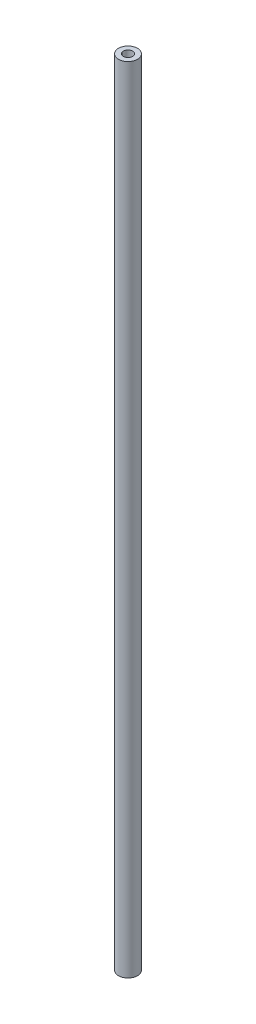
from build123d import *

# Parameters (mm, degrees)
SKETCH1_R           = 21.971
SKETCH1_R_2         = 10.668
BOSS_EXTRUDE1_DEPTH = 1828.8


with BuildPart() as part:
    # Sketch1 → Boss-Extrude1 (new body)
    with BuildSketch(Plane(origin=(0, 0, 0), x_dir=(1, 0, 0), z_dir=(0, 1, 0))):
        with Locations(Location((0, 0, 0), (0, 0, 270))):
            Circle(SKETCH1_R)
        with Locations(Location((0, 0, 0), (0, 0, 270))):
            Circle(SKETCH1_R_2, mode=Mode.SUBTRACT)
    extrude(amount=BOSS_EXTRUDE1_DEPTH)


solid = part.part
